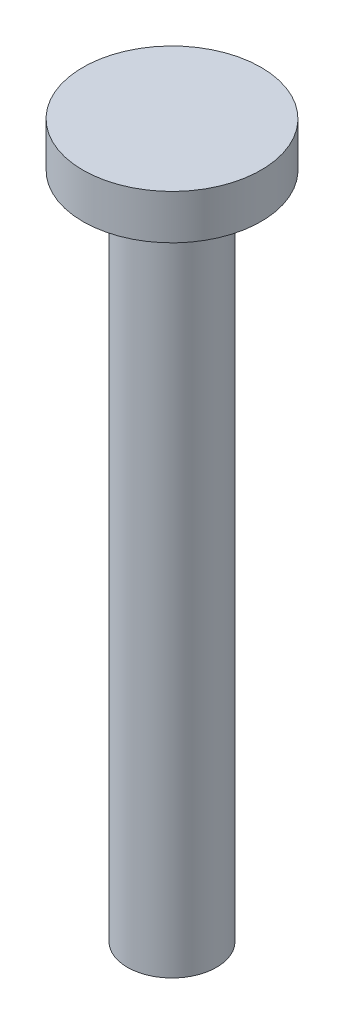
ISO-10303-21;
HEADER;
FILE_DESCRIPTION(('STEP AP214'),'2;1');
FILE_NAME('part.step','',(''),(''),'','','');
FILE_SCHEMA(('AUTOMOTIVE_DESIGN { 1 0 10303 214 1 1 1 1 }'));
ENDSEC;
DATA;
#1=APPLICATION_CONTEXT('core data for automotive mechanical design processes');
#2=APPLICATION_PROTOCOL_DEFINITION('international standard','automotive_design',2000,#1);
#3=PRODUCT_CONTEXT('',#1,'mechanical');
#4=PRODUCT('Part','Part','',(#3));
#5=PRODUCT_RELATED_PRODUCT_CATEGORY('part','',(#4));
#6=PRODUCT_DEFINITION_FORMATION('','',#4);
#7=PRODUCT_DEFINITION_CONTEXT('part definition',#1,'design');
#8=PRODUCT_DEFINITION('design','',#6,#7);
#9=PRODUCT_DEFINITION_SHAPE('','',#8);
#10=(LENGTH_UNIT() NAMED_UNIT(*) SI_UNIT(.MILLI.,.METRE.));
#11=(NAMED_UNIT(*) PLANE_ANGLE_UNIT() SI_UNIT($,.RADIAN.));
#12=(NAMED_UNIT(*) SI_UNIT($,.STERADIAN.) SOLID_ANGLE_UNIT());
#13=UNCERTAINTY_MEASURE_WITH_UNIT(LENGTH_MEASURE(1.E-05),#10,'distance_accuracy_value','');
#14=(GEOMETRIC_REPRESENTATION_CONTEXT(3) GLOBAL_UNCERTAINTY_ASSIGNED_CONTEXT((#13)) GLOBAL_UNIT_ASSIGNED_CONTEXT((#10,
#11,#12)) REPRESENTATION_CONTEXT('',''));
#15=CARTESIAN_POINT('',(0.,0.,0.));
#16=DIRECTION('',(0.,0.,1.));
#17=DIRECTION('',(1.,0.,0.));
#18=AXIS2_PLACEMENT_3D('',#15,#16,#17);
#19=CARTESIAN_POINT('',(0.,15.,0.));
#20=DIRECTION('',(0.,-1.,0.));
#21=DIRECTION('',(0.,0.,-1.));
#22=AXIS2_PLACEMENT_3D('',#19,#20,#21);
#23=CYLINDRICAL_SURFACE('',#22,1.);
#24=CARTESIAN_POINT('',(0.,15.,0.));
#25=DIRECTION('',(0.,1.,0.));
#26=DIRECTION('',(0.,0.,1.));
#27=AXIS2_PLACEMENT_3D('',#24,#25,#26);
#28=CIRCLE('',#27,1.);
#29=CARTESIAN_POINT('',(0.,15.,1.));
#30=VERTEX_POINT('',#29);
#31=EDGE_CURVE('E10',#30,#30,#28,.T.);
#32=ORIENTED_EDGE('',*,*,#31,.F.);
#33=EDGE_LOOP('',(#32));
#34=FACE_BOUND('',#33,.T.);
#35=CARTESIAN_POINT('',(0.,0.,0.));
#36=DIRECTION('',(0.,1.,0.));
#37=DIRECTION('',(0.,0.,1.));
#38=AXIS2_PLACEMENT_3D('',#35,#36,#37);
#39=CIRCLE('',#38,1.);
#40=CARTESIAN_POINT('',(0.,0.,1.));
#41=VERTEX_POINT('',#40);
#42=EDGE_CURVE('E33',#41,#41,#39,.T.);
#43=ORIENTED_EDGE('',*,*,#42,.T.);
#44=EDGE_LOOP('',(#43));
#45=FACE_BOUND('',#44,.T.);
#46=ADVANCED_FACE('F27',(#34,#45),#23,.T.);
#47=CARTESIAN_POINT('',(0.,0.,0.));
#48=DIRECTION('',(0.,1.,0.));
#49=DIRECTION('',(0.,0.,1.));
#50=AXIS2_PLACEMENT_3D('',#47,#48,#49);
#51=PLANE('',#50);
#52=ORIENTED_EDGE('',*,*,#42,.F.);
#53=EDGE_LOOP('',(#52));
#54=FACE_BOUND('',#53,.T.);
#55=ADVANCED_FACE('F51',(#54),#51,.F.);
#56=CARTESIAN_POINT('',(0.,15.,0.));
#57=DIRECTION('',(0.,1.,0.));
#58=DIRECTION('',(0.,0.,1.));
#59=AXIS2_PLACEMENT_3D('',#56,#57,#58);
#60=PLANE('',#59);
#61=CARTESIAN_POINT('',(0.,15.,0.));
#62=DIRECTION('',(0.,1.,0.));
#63=DIRECTION('',(0.,0.,1.));
#64=AXIS2_PLACEMENT_3D('',#61,#62,#63);
#65=CIRCLE('',#64,2.);
#66=CARTESIAN_POINT('',(0.,15.,2.));
#67=VERTEX_POINT('',#66);
#68=EDGE_CURVE('E41',#67,#67,#65,.T.);
#69=ORIENTED_EDGE('',*,*,#68,.F.);
#70=EDGE_LOOP('',(#69));
#71=FACE_BOUND('',#70,.T.);
#72=ORIENTED_EDGE('',*,*,#31,.T.);
#73=EDGE_LOOP('',(#72));
#74=FACE_BOUND('',#73,.T.);
#75=ADVANCED_FACE('F49',(#71,#74),#60,.F.);
#76=CARTESIAN_POINT('',(0.,16.,0.));
#77=DIRECTION('',(0.,-1.,0.));
#78=DIRECTION('',(0.,0.,-1.));
#79=AXIS2_PLACEMENT_3D('',#76,#77,#78);
#80=CYLINDRICAL_SURFACE('',#79,2.);
#81=CARTESIAN_POINT('',(0.,16.,0.));
#82=DIRECTION('',(0.,1.,0.));
#83=DIRECTION('',(0.,0.,1.));
#84=AXIS2_PLACEMENT_3D('',#81,#82,#83);
#85=CIRCLE('',#84,2.);
#86=CARTESIAN_POINT('',(0.,16.,2.));
#87=VERTEX_POINT('',#86);
#88=EDGE_CURVE('E37',#87,#87,#85,.T.);
#89=ORIENTED_EDGE('',*,*,#88,.F.);
#90=EDGE_LOOP('',(#89));
#91=FACE_BOUND('',#90,.T.);
#92=ORIENTED_EDGE('',*,*,#68,.T.);
#93=EDGE_LOOP('',(#92));
#94=FACE_BOUND('',#93,.T.);
#95=ADVANCED_FACE('F47',(#91,#94),#80,.T.);
#96=CARTESIAN_POINT('',(0.,16.,0.));
#97=DIRECTION('',(0.,1.,0.));
#98=DIRECTION('',(0.,0.,1.));
#99=AXIS2_PLACEMENT_3D('',#96,#97,#98);
#100=PLANE('',#99);
#101=ORIENTED_EDGE('',*,*,#88,.T.);
#102=EDGE_LOOP('',(#101));
#103=FACE_BOUND('',#102,.T.);
#104=ADVANCED_FACE('F57',(#103),#100,.T.);
#105=CLOSED_SHELL('',(#46,#55,#75,#95,#104));
#106=MANIFOLD_SOLID_BREP('B2',#105);
#107=ADVANCED_BREP_SHAPE_REPRESENTATION('',(#18,#106),#14);
#108=SHAPE_DEFINITION_REPRESENTATION(#9,#107);
ENDSEC;
END-ISO-10303-21;
